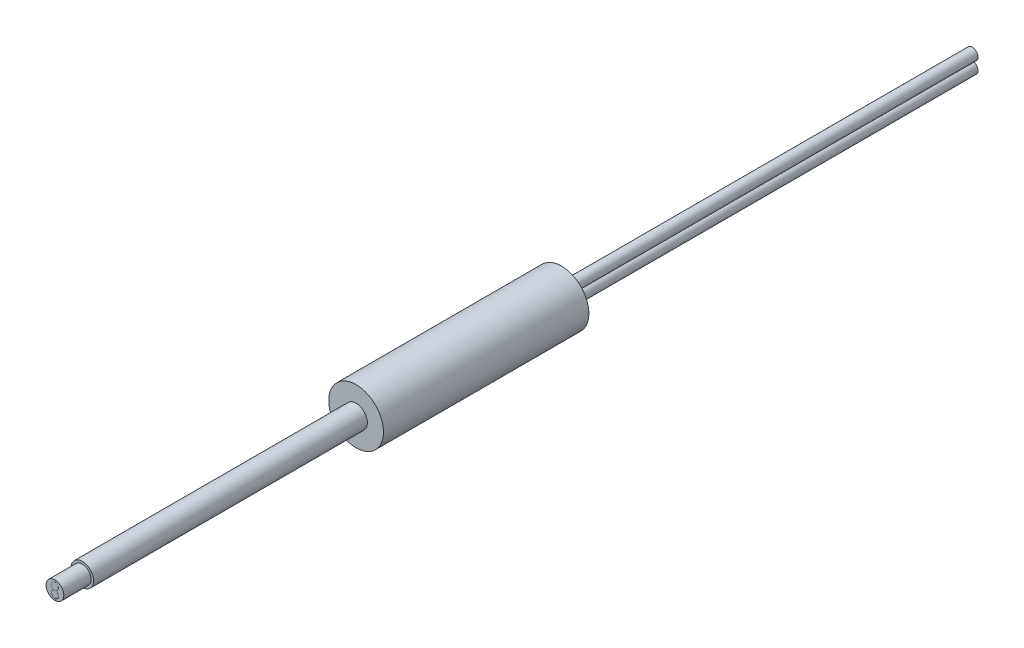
from build123d import *

# Parameters (mm, degrees)
SKETCH_2_R          = 2
EXTRUDE_1_DEPTH     = 15
SKETCH_3_R          = 0.825
EXTRUDE_2_DEPTH     = 20
SKETCH_4_R          = 0.65
EXTRUDE_3_DEPTH     = 2
SKETCH_5_R          = 0.418821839
EXTRUDE_4_DEPTH     = 30
SKETCH_6_R          = 0.255
SKETCH_6_R_2        = 0.25
CUT_EXTRUDE_1_DEPTH = 0.1


with BuildPart() as part:
    # Sketch 2 → Extrude 1 (new body)
    with BuildSketch(Plane.XY):
        Circle(SKETCH_2_R)
    extrude(amount=-EXTRUDE_1_DEPTH)

    # Sketch 3 → Extrude 2 (add)
    with BuildSketch(Plane.XY):
        Circle(SKETCH_3_R)
    extrude(amount=EXTRUDE_2_DEPTH)

    # Sketch 4 → Extrude 3 (add)
    with BuildSketch(Plane.XY.offset(20)):
        Circle(SKETCH_4_R)
    extrude(amount=EXTRUDE_3_DEPTH)

    # Sketch 5 → Extrude 4 (add)
    with BuildSketch(Plane(origin=(0, 0, -15), x_dir=(-1, 0, 0), z_dir=(0, 0, -1))):
        with Locations(Location((0, 0.428821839, 0), (0, 0, 180))):
            Circle(SKETCH_5_R)
        with Locations(Location((0, -0.428821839, 0), (0, 0, 180))):
            Circle(SKETCH_5_R)
    extrude(amount=EXTRUDE_4_DEPTH)

    # Sketch 6 → Cut-Extrude 1 (cut)
    # profile 1 of 2: a face of its own
    with BuildSketch(Plane.XY.offset(22)):
        with Locations((0, 0.265)):
            Circle(SKETCH_6_R)
        with Locations((0, 0.265)):
            Circle(SKETCH_6_R_2, mode=Mode.SUBTRACT)
    # profile 2 of 2: a face of its own
    with BuildSketch(Plane.XY.offset(22)):
        with Locations((0, -0.265)):
            Circle(SKETCH_6_R)
        with Locations((0, -0.265)):
            Circle(SKETCH_6_R_2, mode=Mode.SUBTRACT)
    extrude(amount=-CUT_EXTRUDE_1_DEPTH, mode=Mode.SUBTRACT)


solid = part.part
